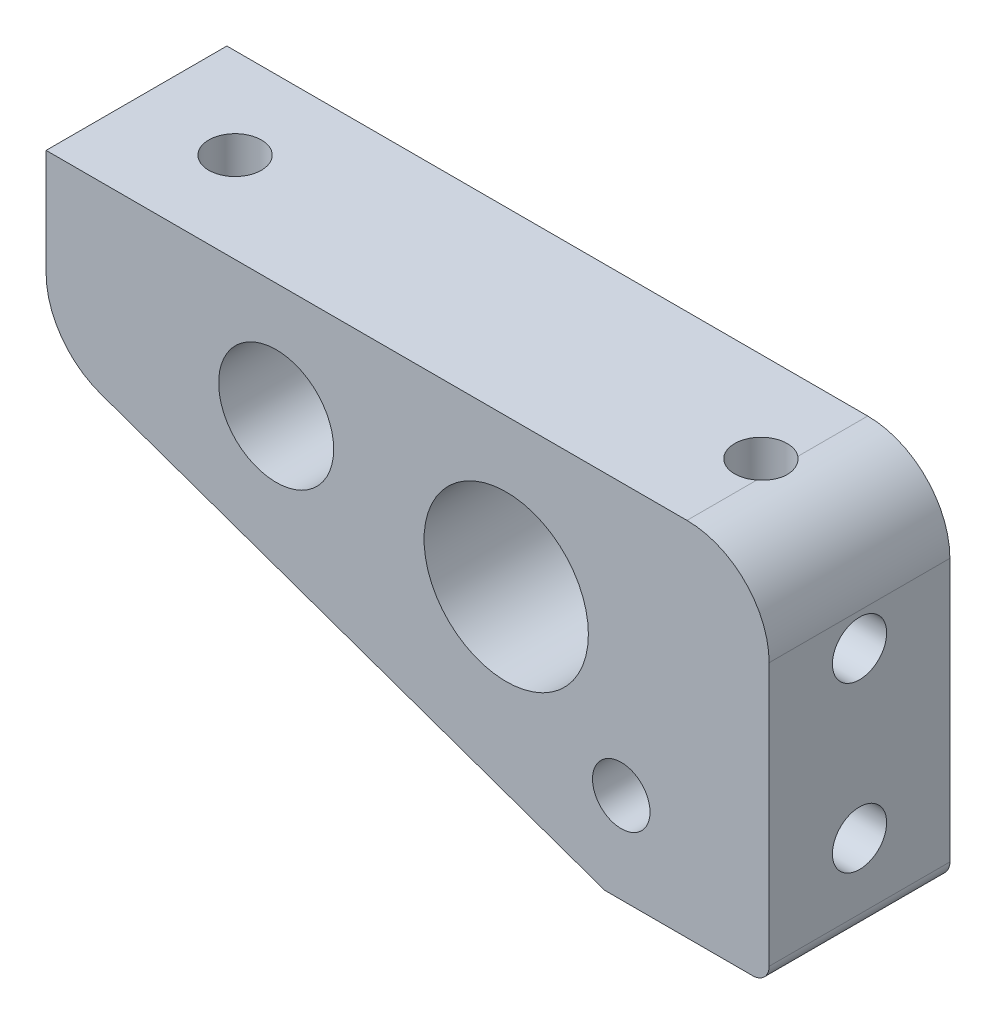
ISO-10303-21;
HEADER;
FILE_DESCRIPTION(('STEP AP214'),'2;1');
FILE_NAME('part.step','',(''),(''),'','','');
FILE_SCHEMA(('AUTOMOTIVE_DESIGN { 1 0 10303 214 1 1 1 1 }'));
ENDSEC;
DATA;
#1=APPLICATION_CONTEXT('core data for automotive mechanical design processes');
#2=APPLICATION_PROTOCOL_DEFINITION('international standard','automotive_design',2000,#1);
#3=PRODUCT_CONTEXT('',#1,'mechanical');
#4=PRODUCT('Part','Part','',(#3));
#5=PRODUCT_RELATED_PRODUCT_CATEGORY('part','',(#4));
#6=PRODUCT_DEFINITION_FORMATION('','',#4);
#7=PRODUCT_DEFINITION_CONTEXT('part definition',#1,'design');
#8=PRODUCT_DEFINITION('design','',#6,#7);
#9=PRODUCT_DEFINITION_SHAPE('','',#8);
#10=(LENGTH_UNIT() NAMED_UNIT(*) SI_UNIT(.MILLI.,.METRE.));
#11=(NAMED_UNIT(*) PLANE_ANGLE_UNIT() SI_UNIT($,.RADIAN.));
#12=(NAMED_UNIT(*) SI_UNIT($,.STERADIAN.) SOLID_ANGLE_UNIT());
#13=UNCERTAINTY_MEASURE_WITH_UNIT(LENGTH_MEASURE(1.E-05),#10,'distance_accuracy_value','');
#14=(GEOMETRIC_REPRESENTATION_CONTEXT(3) GLOBAL_UNCERTAINTY_ASSIGNED_CONTEXT((#13)) GLOBAL_UNIT_ASSIGNED_CONTEXT((#10,
#11,#12)) REPRESENTATION_CONTEXT('',''));
#15=CARTESIAN_POINT('',(0.,0.,0.));
#16=DIRECTION('',(0.,0.,1.));
#17=DIRECTION('',(1.,0.,0.));
#18=AXIS2_PLACEMENT_3D('',#15,#16,#17);
#19=CARTESIAN_POINT('',(0.,-10.,0.));
#20=DIRECTION('',(0.,1.,0.));
#21=DIRECTION('',(0.,0.,1.));
#22=AXIS2_PLACEMENT_3D('',#19,#20,#21);
#23=PLANE('',#22);
#24=CARTESIAN_POINT('',(-6.,-10.,0.));
#25=DIRECTION('',(0.,1.,0.));
#26=DIRECTION('',(0.,0.,1.));
#27=AXIS2_PLACEMENT_3D('',#24,#25,#26);
#28=CIRCLE('',#27,1.6);
#29=CARTESIAN_POINT('',(-6.,-10.,1.6));
#30=VERTEX_POINT('',#29);
#31=EDGE_CURVE('E20',#30,#30,#28,.T.);
#32=ORIENTED_EDGE('',*,*,#31,.T.);
#33=EDGE_LOOP('',(#32));
#34=FACE_BOUND('',#33,.T.);
#35=ADVANCED_FACE('F16',(#34),#23,.T.);
#36=CARTESIAN_POINT('',(-6.,0.,0.));
#37=DIRECTION('',(0.,1.,0.));
#38=DIRECTION('',(0.,0.,1.));
#39=AXIS2_PLACEMENT_3D('',#36,#37,#38);
#40=CYLINDRICAL_SURFACE('',#39,1.6);
#41=ORIENTED_EDGE('',*,*,#31,.F.);
#42=EDGE_LOOP('',(#41));
#43=FACE_BOUND('',#42,.T.);
#44=CARTESIAN_POINT('',(-7.6,-8.65,0.));
#45=CARTESIAN_POINT('',(-7.59999044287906,-8.64999049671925,0.0720842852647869));
#46=CARTESIAN_POINT('',(-7.59507938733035,-8.6452271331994,0.144295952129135));
#47=CARTESIAN_POINT('',(-7.57581147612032,-8.62655355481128,0.286344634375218));
#48=CARTESIAN_POINT('',(-7.56142638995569,-8.61261600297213,0.356173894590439));
#49=CARTESIAN_POINT('',(-7.52443546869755,-8.57682648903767,0.490854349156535));
#50=CARTESIAN_POINT('',(-7.50189028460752,-8.55503292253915,0.555738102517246));
#51=CARTESIAN_POINT('',(-7.44993008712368,-8.50490882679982,0.679881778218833));
#52=CARTESIAN_POINT('',(-7.42051635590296,-8.47657951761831,0.739142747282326));
#53=CARTESIAN_POINT('',(-7.3429151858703,-8.40205549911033,0.874594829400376));
#54=CARTESIAN_POINT('',(-7.29197093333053,-8.35329407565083,0.947789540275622));
#55=CARTESIAN_POINT('',(-7.18186309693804,-8.24860038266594,1.08202458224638));
#56=CARTESIAN_POINT('',(-7.12267566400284,-8.19264734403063,1.14302834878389));
#57=CARTESIAN_POINT('',(-7.01825487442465,-8.0950437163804,1.23544553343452));
#58=CARTESIAN_POINT('',(-6.97466827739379,-8.05459203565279,1.27006065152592));
#59=CARTESIAN_POINT('',(-6.88498918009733,-7.97230851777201,1.33410411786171));
#60=CARTESIAN_POINT('',(-6.83889513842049,-7.93047583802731,1.36352922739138));
#61=CARTESIAN_POINT('',(-6.74444096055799,-7.84630585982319,1.41730640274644));
#62=CARTESIAN_POINT('',(-6.69608435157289,-7.80396941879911,1.44166606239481));
#63=CARTESIAN_POINT('',(-6.59687253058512,-7.71975547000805,1.48549339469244));
#64=CARTESIAN_POINT('',(-6.54601954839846,-7.67787759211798,1.50496534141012));
#65=CARTESIAN_POINT('',(-6.45875091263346,-7.6103100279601,1.53325650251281));
#66=CARTESIAN_POINT('',(-6.42329544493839,-7.58395150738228,1.54344793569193));
#67=CARTESIAN_POINT('',(-6.35028297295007,-7.53337725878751,1.56164086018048));
#68=CARTESIAN_POINT('',(-6.31272620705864,-7.50916128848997,1.56964259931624));
#69=CARTESIAN_POINT('',(-6.24666455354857,-7.47206939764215,1.58110876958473));
#70=CARTESIAN_POINT('',(-6.21895465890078,-7.45800312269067,1.5852110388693));
#71=CARTESIAN_POINT('',(-6.16177587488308,-7.43359976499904,1.59205890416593));
#72=CARTESIAN_POINT('',(-6.13231281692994,-7.42325104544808,1.59480874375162));
#73=CARTESIAN_POINT('',(-6.0795537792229,-7.41031266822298,1.59817953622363));
#74=CARTESIAN_POINT('',(-6.05661629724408,-7.40641315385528,1.59916578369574));
#75=CARTESIAN_POINT('',(-6.01040944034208,-7.40259391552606,1.60013219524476));
#76=CARTESIAN_POINT('',(-5.98714072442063,-7.40266716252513,1.60011413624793));
#77=CARTESIAN_POINT('',(-5.9410635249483,-7.40674907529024,1.59908035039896));
#78=CARTESIAN_POINT('',(-5.91825391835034,-7.4107465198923,1.5980674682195));
#79=CARTESIAN_POINT('',(-5.87347506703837,-7.42194599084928,1.59514771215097));
#80=CARTESIAN_POINT('',(-5.85150808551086,-7.42915606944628,1.593238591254));
#81=CARTESIAN_POINT('',(-5.77614256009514,-7.4583685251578,1.58519513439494));
#82=CARTESIAN_POINT('',(-5.72535465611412,-7.48627049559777,1.57703306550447));
#83=CARTESIAN_POINT('',(-5.62779337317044,-7.54737257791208,1.55690736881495));
#84=CARTESIAN_POINT('',(-5.5810580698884,-7.58061598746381,1.54491180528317));
#85=CARTESIAN_POINT('',(-5.48618961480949,-7.65227572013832,1.51613192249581));
#86=CARTESIAN_POINT('',(-5.43830279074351,-7.6908890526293,1.49901621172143));
#87=CARTESIAN_POINT('',(-5.34481934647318,-7.76883412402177,1.46057975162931));
#88=CARTESIAN_POINT('',(-5.29922490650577,-7.80816650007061,1.43925509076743));
#89=CARTESIAN_POINT('',(-5.21020187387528,-7.88647461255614,1.39238604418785));
#90=CARTESIAN_POINT('',(-5.16676717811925,-7.9254510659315,1.36685454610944));
#91=CARTESIAN_POINT('',(-5.0819771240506,-8.00247437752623,1.31141046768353));
#92=CARTESIAN_POINT('',(-5.04062071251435,-8.04052170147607,1.28150013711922));
#93=CARTESIAN_POINT('',(-4.93509418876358,-8.13838585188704,1.19706890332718));
#94=CARTESIAN_POINT('',(-4.87273773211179,-8.19702015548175,1.13881365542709));
#95=CARTESIAN_POINT('',(-4.75575825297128,-8.30778148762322,1.00966691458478));
#96=CARTESIAN_POINT('',(-4.7011258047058,-8.35991643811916,0.938791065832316));
#97=CARTESIAN_POINT('',(-4.61410739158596,-8.44328901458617,0.802616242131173));
#98=CARTESIAN_POINT('',(-4.57951775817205,-8.47655083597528,0.739977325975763));
#99=CARTESIAN_POINT('',(-4.51811848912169,-8.53571000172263,0.607718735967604));
#100=CARTESIAN_POINT('',(-4.49130297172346,-8.56161291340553,0.538104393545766));
#101=CARTESIAN_POINT('',(-4.45040214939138,-8.60116542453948,0.403675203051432));
#102=CARTESIAN_POINT('',(-4.43504025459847,-8.61604188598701,0.339611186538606));
#103=CARTESIAN_POINT('',(-4.41231699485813,-8.63805650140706,0.208881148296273));
#104=CARTESIAN_POINT('',(-4.40493320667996,-8.64521634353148,0.142222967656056));
#105=CARTESIAN_POINT('',(-4.40058840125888,-8.64942948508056,0.0502172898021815));
#106=CARTESIAN_POINT('',(-4.39999667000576,-8.65000331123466,0.0251163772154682));
#107=CARTESIAN_POINT('',(-4.40000955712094,-8.64999049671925,-0.0720842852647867));
#108=CARTESIAN_POINT('',(-4.40492061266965,-8.6452271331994,-0.144295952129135));
#109=CARTESIAN_POINT('',(-4.42418852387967,-8.62655355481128,-0.286344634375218));
#110=CARTESIAN_POINT('',(-4.43857361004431,-8.61261600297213,-0.356173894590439));
#111=CARTESIAN_POINT('',(-4.47556453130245,-8.57682648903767,-0.490854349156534));
#112=CARTESIAN_POINT('',(-4.49810971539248,-8.55503292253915,-0.555738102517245));
#113=CARTESIAN_POINT('',(-4.55006991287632,-8.50490882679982,-0.679881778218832));
#114=CARTESIAN_POINT('',(-4.57948364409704,-8.47657951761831,-0.739142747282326));
#115=CARTESIAN_POINT('',(-4.6570848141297,-8.40205549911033,-0.874594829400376));
#116=CARTESIAN_POINT('',(-4.70802906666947,-8.35329407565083,-0.947789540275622));
#117=CARTESIAN_POINT('',(-4.81813690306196,-8.24860038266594,-1.08202458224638));
#118=CARTESIAN_POINT('',(-4.87732433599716,-8.19264734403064,-1.14302834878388));
#119=CARTESIAN_POINT('',(-4.98174512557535,-8.0950437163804,-1.23544553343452));
#120=CARTESIAN_POINT('',(-5.02533172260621,-8.05459203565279,-1.27006065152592));
#121=CARTESIAN_POINT('',(-5.11501081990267,-7.97230851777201,-1.33410411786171));
#122=CARTESIAN_POINT('',(-5.16110486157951,-7.93047583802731,-1.36352922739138));
#123=CARTESIAN_POINT('',(-5.25555903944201,-7.84630585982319,-1.41730640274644));
#124=CARTESIAN_POINT('',(-5.30391564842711,-7.80396941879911,-1.44166606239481));
#125=CARTESIAN_POINT('',(-5.40312746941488,-7.71975547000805,-1.48549339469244));
#126=CARTESIAN_POINT('',(-5.45398045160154,-7.67787759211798,-1.50496534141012));
#127=CARTESIAN_POINT('',(-5.54124908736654,-7.6103100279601,-1.53325650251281));
#128=CARTESIAN_POINT('',(-5.57670455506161,-7.58395150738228,-1.54344793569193));
#129=CARTESIAN_POINT('',(-5.64971702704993,-7.53337725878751,-1.56164086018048));
#130=CARTESIAN_POINT('',(-5.68727379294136,-7.50916128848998,-1.56964259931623));
#131=CARTESIAN_POINT('',(-5.75333544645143,-7.47206939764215,-1.58110876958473));
#132=CARTESIAN_POINT('',(-5.78104534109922,-7.45800312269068,-1.58521103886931));
#133=CARTESIAN_POINT('',(-5.83822412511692,-7.43359976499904,-1.59205890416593));
#134=CARTESIAN_POINT('',(-5.86768718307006,-7.42325104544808,-1.59480874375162));
#135=CARTESIAN_POINT('',(-5.9204462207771,-7.41031266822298,-1.59817953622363));
#136=CARTESIAN_POINT('',(-5.94338370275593,-7.40641315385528,-1.59916578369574));
#137=CARTESIAN_POINT('',(-5.98959055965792,-7.40259391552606,-1.60013219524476));
#138=CARTESIAN_POINT('',(-6.01285927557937,-7.40266716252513,-1.60011413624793));
#139=CARTESIAN_POINT('',(-6.0589364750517,-7.40674907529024,-1.59908035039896));
#140=CARTESIAN_POINT('',(-6.08174608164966,-7.4107465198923,-1.5980674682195));
#141=CARTESIAN_POINT('',(-6.12652493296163,-7.42194599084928,-1.59514771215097));
#142=CARTESIAN_POINT('',(-6.14849191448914,-7.42915606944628,-1.593238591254));
#143=CARTESIAN_POINT('',(-6.22385743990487,-7.4583685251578,-1.58519513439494));
#144=CARTESIAN_POINT('',(-6.27464534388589,-7.48627049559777,-1.57703306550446));
#145=CARTESIAN_POINT('',(-6.37220662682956,-7.54737257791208,-1.55690736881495));
#146=CARTESIAN_POINT('',(-6.41894193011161,-7.58061598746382,-1.54491180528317));
#147=CARTESIAN_POINT('',(-6.51381038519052,-7.65227572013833,-1.51613192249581));
#148=CARTESIAN_POINT('',(-6.56169720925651,-7.69088905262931,-1.49901621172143));
#149=CARTESIAN_POINT('',(-6.65518065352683,-7.76883412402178,-1.4605797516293));
#150=CARTESIAN_POINT('',(-6.70077509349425,-7.80816650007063,-1.43925509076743));
#151=CARTESIAN_POINT('',(-6.78979812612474,-7.88647461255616,-1.39238604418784));
#152=CARTESIAN_POINT('',(-6.83323282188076,-7.92545106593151,-1.36685454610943));
#153=CARTESIAN_POINT('',(-6.91802287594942,-8.00247437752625,-1.31141046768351));
#154=CARTESIAN_POINT('',(-6.95937928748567,-8.04052170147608,-1.2815001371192));
#155=CARTESIAN_POINT('',(-7.06490581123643,-8.13838585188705,-1.19706890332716));
#156=CARTESIAN_POINT('',(-7.12726226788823,-8.19702015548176,-1.13881365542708));
#157=CARTESIAN_POINT('',(-7.24424174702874,-8.30778148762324,-1.00966691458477));
#158=CARTESIAN_POINT('',(-7.29887419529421,-8.35991643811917,-0.938791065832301));
#159=CARTESIAN_POINT('',(-7.38589260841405,-8.44328901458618,-0.802616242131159));
#160=CARTESIAN_POINT('',(-7.42048224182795,-8.47655083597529,-0.739977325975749));
#161=CARTESIAN_POINT('',(-7.48188151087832,-8.53571000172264,-0.60771873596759));
#162=CARTESIAN_POINT('',(-7.50869702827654,-8.56161291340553,-0.538104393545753));
#163=CARTESIAN_POINT('',(-7.54959785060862,-8.60116542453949,-0.403675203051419));
#164=CARTESIAN_POINT('',(-7.56495974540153,-8.61604188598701,-0.339611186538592));
#165=CARTESIAN_POINT('',(-7.58768300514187,-8.63805650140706,-0.208881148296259));
#166=CARTESIAN_POINT('',(-7.59506679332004,-8.64521634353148,-0.142222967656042));
#167=CARTESIAN_POINT('',(-7.59941159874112,-8.64942948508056,-0.0502172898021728));
#168=CARTESIAN_POINT('',(-7.60000332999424,-8.65000331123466,-0.0251163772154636));
#169=CARTESIAN_POINT('',(-7.6,-8.65,0.));
#170=B_SPLINE_CURVE_WITH_KNOTS('',3,(#44,#45,#46,#47,#48,#49,#50,#51,#52,#53,#54,#55,#56,#57,
#58,#59,#60,#61,#62,#63,#64,#65,#66,#67,#68,#69,#70,#71,#72,#73,#74,#75,#76,#77,#78,#79,#80,#81,
#82,#83,#84,#85,#86,#87,#88,#89,#90,#91,#92,#93,#94,#95,#96,#97,#98,#99,#100,#101,#102,#103,
#104,#105,#106,#107,#108,#109,#110,#111,#112,#113,#114,#115,#116,#117,#118,#119,#120,#121,#122,
#123,#124,#125,#126,#127,#128,#129,#130,#131,#132,#133,#134,#135,#136,#137,#138,#139,#140,#141,
#142,#143,#144,#145,#146,#147,#148,#149,#150,#151,#152,#153,#154,#155,#156,#157,#158,#159,#160,
#161,#162,#163,#164,#165,#166,#167,#168,#169),.UNSPECIFIED.,.T.,.F.,(4,2,2,2,2,2,2,2,2,2,2,2,2,
2,2,2,2,2,2,2,2,2,2,2,2,2,2,2,2,2,2,2,2,2,2,2,2,2,2,2,2,2,2,2,2,2,2,2,2,2,2,2,2,2,2,2,2,2,2,2,2,
2,4),(0.,0.216164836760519,0.43297672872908,0.648209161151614,0.863401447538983,
1.16665917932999,1.47081326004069,1.67698968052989,1.88329430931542,2.08928739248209,
2.29509971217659,2.43103535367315,2.56695560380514,2.66081833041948,2.7543846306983,
2.82393118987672,2.89335470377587,2.9625802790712,3.03198034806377,3.20614545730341,
3.38180106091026,3.57310386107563,3.76458529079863,3.95549066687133,4.14629830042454,
4.45581255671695,4.76494578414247,5.00080613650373,5.23648757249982,5.43825506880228,
5.63945399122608,5.71477245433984,5.93093729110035,6.14774918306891,6.36298161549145,
6.57817390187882,6.88143163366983,7.18558571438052,7.39176213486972,7.59806676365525,
7.80405984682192,8.00987216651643,8.14580780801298,8.28172805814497,8.37559078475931,
8.46915708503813,8.53870364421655,8.6081271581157,8.67735273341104,8.7467528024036,
8.92091791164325,9.0965735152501,9.28787631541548,9.47935774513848,9.67026312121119,
9.8610707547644,10.1705850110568,10.4797182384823,10.7155785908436,10.9512600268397,
11.1530275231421,11.3542264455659,11.4295449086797),.UNSPECIFIED.);
#171=CARTESIAN_POINT('',(-7.6,-8.65,0.));
#172=VERTEX_POINT('',#171);
#173=EDGE_CURVE('E258',#172,#172,#170,.T.);
#174=ORIENTED_EDGE('',*,*,#173,.T.);
#175=EDGE_LOOP('',(#174));
#176=FACE_BOUND('',#175,.T.);
#177=ADVANCED_FACE('F263',(#43,#176),#40,.F.);
#178=CARTESIAN_POINT('',(-10.,0.,0.));
#179=DIRECTION('',(1.,0.,0.));
#180=DIRECTION('',(0.,0.,-1.));
#181=AXIS2_PLACEMENT_3D('',#178,#179,#180);
#182=PLANE('',#181);
#183=CARTESIAN_POINT('',(-10.,-7.,0.));
#184=DIRECTION('',(1.,0.,0.));
#185=DIRECTION('',(0.,0.,-1.));
#186=AXIS2_PLACEMENT_3D('',#183,#184,#185);
#187=CIRCLE('',#186,1.65);
#188=CARTESIAN_POINT('',(-10.,-7.,-1.65));
#189=VERTEX_POINT('',#188);
#190=EDGE_CURVE('E256',#189,#189,#187,.T.);
#191=ORIENTED_EDGE('',*,*,#190,.T.);
#192=EDGE_LOOP('',(#191));
#193=FACE_BOUND('',#192,.T.);
#194=ADVANCED_FACE('F268',(#193),#182,.T.);
#195=CARTESIAN_POINT('',(0.,-10.,0.));
#196=DIRECTION('',(0.,1.,0.));
#197=DIRECTION('',(0.,0.,1.));
#198=AXIS2_PLACEMENT_3D('',#195,#196,#197);
#199=PLANE('',#198);
#200=CARTESIAN_POINT('',(-38.,-10.,0.));
#201=DIRECTION('',(0.,1.,0.));
#202=DIRECTION('',(0.,0.,1.));
#203=AXIS2_PLACEMENT_3D('',#200,#201,#202);
#204=CIRCLE('',#203,1.6);
#205=CARTESIAN_POINT('',(-38.,-10.,1.6));
#206=VERTEX_POINT('',#205);
#207=EDGE_CURVE('E103',#206,#206,#204,.T.);
#208=ORIENTED_EDGE('',*,*,#207,.T.);
#209=EDGE_LOOP('',(#208));
#210=FACE_BOUND('',#209,.T.);
#211=ADVANCED_FACE('F271',(#210),#199,.T.);
#212=CARTESIAN_POINT('',(0.,-7.,0.));
#213=DIRECTION('',(1.,0.,0.));
#214=DIRECTION('',(0.,0.,-1.));
#215=AXIS2_PLACEMENT_3D('',#212,#213,#214);
#216=CYLINDRICAL_SURFACE('',#215,1.65);
#217=ORIENTED_EDGE('',*,*,#190,.F.);
#218=EDGE_LOOP('',(#217));
#219=FACE_BOUND('',#218,.T.);
#220=CARTESIAN_POINT('',(-4.4,-5.35,0.));
#221=CARTESIAN_POINT('',(-4.40000955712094,-5.35000950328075,-0.0720842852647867));
#222=CARTESIAN_POINT('',(-4.40492061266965,-5.35477286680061,-0.144295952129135));
#223=CARTESIAN_POINT('',(-4.42418852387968,-5.37344644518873,-0.286344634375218));
#224=CARTESIAN_POINT('',(-4.43857361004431,-5.38738399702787,-0.356173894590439));
#225=CARTESIAN_POINT('',(-4.47556453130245,-5.42317351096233,-0.490854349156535));
#226=CARTESIAN_POINT('',(-4.49810971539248,-5.44496707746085,-0.555738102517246));
#227=CARTESIAN_POINT('',(-4.55006991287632,-5.49509117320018,-0.679881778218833));
#228=CARTESIAN_POINT('',(-4.57948364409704,-5.52342048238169,-0.739142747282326));
#229=CARTESIAN_POINT('',(-4.6570848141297,-5.59794450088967,-0.874594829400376));
#230=CARTESIAN_POINT('',(-4.70802906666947,-5.64670592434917,-0.947789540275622));
#231=CARTESIAN_POINT('',(-4.81813690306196,-5.75139961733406,-1.08202458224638));
#232=CARTESIAN_POINT('',(-4.87732433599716,-5.80735265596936,-1.14302834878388));
#233=CARTESIAN_POINT('',(-4.98174512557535,-5.9049562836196,-1.23544553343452));
#234=CARTESIAN_POINT('',(-5.02533172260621,-5.94540796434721,-1.27006065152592));
#235=CARTESIAN_POINT('',(-5.11501081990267,-6.02769148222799,-1.33410411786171));
#236=CARTESIAN_POINT('',(-5.16110486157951,-6.06952416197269,-1.36352922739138));
#237=CARTESIAN_POINT('',(-5.25555903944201,-6.15369414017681,-1.41730640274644));
#238=CARTESIAN_POINT('',(-5.30391564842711,-6.19603058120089,-1.44166606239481));
#239=CARTESIAN_POINT('',(-5.40312746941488,-6.28024452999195,-1.48549339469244));
#240=CARTESIAN_POINT('',(-5.45398045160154,-6.32212240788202,-1.50496534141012));
#241=CARTESIAN_POINT('',(-5.54124908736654,-6.3896899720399,-1.53325650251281));
#242=CARTESIAN_POINT('',(-5.57670455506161,-6.41604849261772,-1.54344793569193));
#243=CARTESIAN_POINT('',(-5.64971702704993,-6.46662274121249,-1.56164086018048));
#244=CARTESIAN_POINT('',(-5.68727379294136,-6.49083871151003,-1.56964259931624));
#245=CARTESIAN_POINT('',(-5.75333544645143,-6.52793060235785,-1.58110876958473));
#246=CARTESIAN_POINT('',(-5.78104534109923,-6.54199687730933,-1.5852110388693));
#247=CARTESIAN_POINT('',(-5.83822412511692,-6.56640023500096,-1.59205890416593));
#248=CARTESIAN_POINT('',(-5.86768718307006,-6.57674895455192,-1.59480874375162));
#249=CARTESIAN_POINT('',(-5.9204462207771,-6.58968733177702,-1.59817953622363));
#250=CARTESIAN_POINT('',(-5.94338370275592,-6.59358684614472,-1.59916578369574));
#251=CARTESIAN_POINT('',(-5.98959055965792,-6.59740608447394,-1.60013219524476));
#252=CARTESIAN_POINT('',(-6.01285927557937,-6.59733283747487,-1.60011413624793));
#253=CARTESIAN_POINT('',(-6.0589364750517,-6.59325092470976,-1.59908035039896));
#254=CARTESIAN_POINT('',(-6.08174608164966,-6.5892534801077,-1.5980674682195));
#255=CARTESIAN_POINT('',(-6.12652493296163,-6.57805400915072,-1.59514771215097));
#256=CARTESIAN_POINT('',(-6.14849191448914,-6.57084393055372,-1.593238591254));
#257=CARTESIAN_POINT('',(-6.22385743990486,-6.5416314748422,-1.58519513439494));
#258=CARTESIAN_POINT('',(-6.27464534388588,-6.51372950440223,-1.57703306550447));
#259=CARTESIAN_POINT('',(-6.37220662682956,-6.45262742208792,-1.55690736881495));
#260=CARTESIAN_POINT('',(-6.4189419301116,-6.41938401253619,-1.54491180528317));
#261=CARTESIAN_POINT('',(-6.51381038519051,-6.34772427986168,-1.51613192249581));
#262=CARTESIAN_POINT('',(-6.5616972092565,-6.3091109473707,-1.49901621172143));
#263=CARTESIAN_POINT('',(-6.65518065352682,-6.23116587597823,-1.46057975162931));
#264=CARTESIAN_POINT('',(-6.70077509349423,-6.19183349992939,-1.43925509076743));
#265=CARTESIAN_POINT('',(-6.78979812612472,-6.11352538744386,-1.39238604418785));
#266=CARTESIAN_POINT('',(-6.83323282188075,-6.0745489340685,-1.36685454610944));
#267=CARTESIAN_POINT('',(-6.9180228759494,-5.99752562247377,-1.31141046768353));
#268=CARTESIAN_POINT('',(-6.95937928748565,-5.95947829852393,-1.28150013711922));
#269=CARTESIAN_POINT('',(-7.06490581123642,-5.86161414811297,-1.19706890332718));
#270=CARTESIAN_POINT('',(-7.12726226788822,-5.80297984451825,-1.13881365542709));
#271=CARTESIAN_POINT('',(-7.24424174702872,-5.69221851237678,-1.00966691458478));
#272=CARTESIAN_POINT('',(-7.2988741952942,-5.64008356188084,-0.938791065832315));
#273=CARTESIAN_POINT('',(-7.38589260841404,-5.55671098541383,-0.802616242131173));
#274=CARTESIAN_POINT('',(-7.42048224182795,-5.52344916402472,-0.739977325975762));
#275=CARTESIAN_POINT('',(-7.48188151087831,-5.46428999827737,-0.607718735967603));
#276=CARTESIAN_POINT('',(-7.50869702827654,-5.43838708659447,-0.538104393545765));
#277=CARTESIAN_POINT('',(-7.54959785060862,-5.39883457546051,-0.403675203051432));
#278=CARTESIAN_POINT('',(-7.56495974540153,-5.38395811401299,-0.339611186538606));
#279=CARTESIAN_POINT('',(-7.58768300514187,-5.36194349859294,-0.208881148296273));
#280=CARTESIAN_POINT('',(-7.59506679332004,-5.35478365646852,-0.142222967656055));
#281=CARTESIAN_POINT('',(-7.59941159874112,-5.35057051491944,-0.050217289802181));
#282=CARTESIAN_POINT('',(-7.60000332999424,-5.34999668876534,-0.0251163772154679));
#283=CARTESIAN_POINT('',(-7.59999044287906,-5.35000950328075,0.0720842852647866));
#284=CARTESIAN_POINT('',(-7.59507938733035,-5.35477286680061,0.144295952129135));
#285=CARTESIAN_POINT('',(-7.57581147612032,-5.37344644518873,0.286344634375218));
#286=CARTESIAN_POINT('',(-7.56142638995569,-5.38738399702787,0.356173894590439));
#287=CARTESIAN_POINT('',(-7.52443546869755,-5.42317351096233,0.490854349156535));
#288=CARTESIAN_POINT('',(-7.50189028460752,-5.44496707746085,0.555738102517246));
#289=CARTESIAN_POINT('',(-7.44993008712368,-5.49509117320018,0.679881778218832));
#290=CARTESIAN_POINT('',(-7.42051635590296,-5.52342048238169,0.739142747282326));
#291=CARTESIAN_POINT('',(-7.3429151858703,-5.59794450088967,0.874594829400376));
#292=CARTESIAN_POINT('',(-7.29197093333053,-5.64670592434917,0.947789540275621));
#293=CARTESIAN_POINT('',(-7.18186309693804,-5.75139961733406,1.08202458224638));
#294=CARTESIAN_POINT('',(-7.12267566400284,-5.80735265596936,1.14302834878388));
#295=CARTESIAN_POINT('',(-7.01825487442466,-5.9049562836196,1.23544553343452));
#296=CARTESIAN_POINT('',(-6.97466827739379,-5.94540796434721,1.27006065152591));
#297=CARTESIAN_POINT('',(-6.88498918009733,-6.02769148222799,1.33410411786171));
#298=CARTESIAN_POINT('',(-6.83889513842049,-6.06952416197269,1.36352922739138));
#299=CARTESIAN_POINT('',(-6.74444096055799,-6.15369414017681,1.41730640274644));
#300=CARTESIAN_POINT('',(-6.69608435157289,-6.19603058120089,1.44166606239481));
#301=CARTESIAN_POINT('',(-6.59687253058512,-6.28024452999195,1.48549339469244));
#302=CARTESIAN_POINT('',(-6.54601954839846,-6.32212240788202,1.50496534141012));
#303=CARTESIAN_POINT('',(-6.45875091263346,-6.3896899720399,1.53325650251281));
#304=CARTESIAN_POINT('',(-6.42329544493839,-6.41604849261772,1.54344793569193));
#305=CARTESIAN_POINT('',(-6.35028297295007,-6.46662274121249,1.56164086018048));
#306=CARTESIAN_POINT('',(-6.31272620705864,-6.49083871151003,1.56964259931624));
#307=CARTESIAN_POINT('',(-6.24666455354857,-6.52793060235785,1.58110876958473));
#308=CARTESIAN_POINT('',(-6.21895465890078,-6.54199687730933,1.5852110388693));
#309=CARTESIAN_POINT('',(-6.16177587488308,-6.56640023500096,1.59205890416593));
#310=CARTESIAN_POINT('',(-6.13231281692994,-6.57674895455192,1.59480874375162));
#311=CARTESIAN_POINT('',(-6.0795537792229,-6.58968733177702,1.59817953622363));
#312=CARTESIAN_POINT('',(-6.05661629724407,-6.59358684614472,1.59916578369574));
#313=CARTESIAN_POINT('',(-6.01040944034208,-6.59740608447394,1.60013219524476));
#314=CARTESIAN_POINT('',(-5.98714072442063,-6.59733283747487,1.60011413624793));
#315=CARTESIAN_POINT('',(-5.9410635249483,-6.59325092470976,1.59908035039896));
#316=CARTESIAN_POINT('',(-5.91825391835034,-6.5892534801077,1.5980674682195));
#317=CARTESIAN_POINT('',(-5.87347506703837,-6.57805400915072,1.59514771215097));
#318=CARTESIAN_POINT('',(-5.85150808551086,-6.57084393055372,1.593238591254));
#319=CARTESIAN_POINT('',(-5.77614256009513,-6.5416314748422,1.58519513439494));
#320=CARTESIAN_POINT('',(-5.72535465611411,-6.51372950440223,1.57703306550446));
#321=CARTESIAN_POINT('',(-5.62779337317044,-6.45262742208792,1.55690736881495));
#322=CARTESIAN_POINT('',(-5.58105806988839,-6.41938401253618,1.54491180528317));
#323=CARTESIAN_POINT('',(-5.48618961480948,-6.34772427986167,1.51613192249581));
#324=CARTESIAN_POINT('',(-5.43830279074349,-6.30911094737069,1.49901621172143));
#325=CARTESIAN_POINT('',(-5.34481934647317,-6.23116587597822,1.4605797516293));
#326=CARTESIAN_POINT('',(-5.29922490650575,-6.19183349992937,1.43925509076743));
#327=CARTESIAN_POINT('',(-5.21020187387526,-6.11352538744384,1.39238604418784));
#328=CARTESIAN_POINT('',(-5.16676717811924,-6.07454893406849,1.36685454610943));
#329=CARTESIAN_POINT('',(-5.08197712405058,-5.99752562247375,1.31141046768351));
#330=CARTESIAN_POINT('',(-5.04062071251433,-5.95947829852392,1.2815001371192));
#331=CARTESIAN_POINT('',(-4.93509418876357,-5.86161414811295,1.19706890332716));
#332=CARTESIAN_POINT('',(-4.87273773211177,-5.80297984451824,1.13881365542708));
#333=CARTESIAN_POINT('',(-4.75575825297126,-5.69221851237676,1.00966691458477));
#334=CARTESIAN_POINT('',(-4.70112580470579,-5.64008356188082,0.938791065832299));
#335=CARTESIAN_POINT('',(-4.61410739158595,-5.55671098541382,0.802616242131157));
#336=CARTESIAN_POINT('',(-4.57951775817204,-5.52344916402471,0.739977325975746));
#337=CARTESIAN_POINT('',(-4.51811848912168,-5.46428999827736,0.607718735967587));
#338=CARTESIAN_POINT('',(-4.49130297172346,-5.43838708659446,0.538104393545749));
#339=CARTESIAN_POINT('',(-4.45040214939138,-5.39883457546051,0.403675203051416));
#340=CARTESIAN_POINT('',(-4.43504025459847,-5.38395811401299,0.33961118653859));
#341=CARTESIAN_POINT('',(-4.41231699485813,-5.36194349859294,0.208881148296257));
#342=CARTESIAN_POINT('',(-4.40493320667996,-5.35478365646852,0.142222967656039));
#343=CARTESIAN_POINT('',(-4.40058840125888,-5.35057051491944,0.0502172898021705));
#344=CARTESIAN_POINT('',(-4.39999667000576,-5.34999668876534,0.0251163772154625));
#345=CARTESIAN_POINT('',(-4.4,-5.35,0.));
#346=B_SPLINE_CURVE_WITH_KNOTS('',3,(#220,#221,#222,#223,#224,#225,#226,#227,#228,#229,#230,
#231,#232,#233,#234,#235,#236,#237,#238,#239,#240,#241,#242,#243,#244,#245,#246,#247,#248,#249,
#250,#251,#252,#253,#254,#255,#256,#257,#258,#259,#260,#261,#262,#263,#264,#265,#266,#267,#268,
#269,#270,#271,#272,#273,#274,#275,#276,#277,#278,#279,#280,#281,#282,#283,#284,#285,#286,#287,
#288,#289,#290,#291,#292,#293,#294,#295,#296,#297,#298,#299,#300,#301,#302,#303,#304,#305,#306,
#307,#308,#309,#310,#311,#312,#313,#314,#315,#316,#317,#318,#319,#320,#321,#322,#323,#324,#325,
#326,#327,#328,#329,#330,#331,#332,#333,#334,#335,#336,#337,#338,#339,#340,#341,#342,#343,#344,
#345),.UNSPECIFIED.,.T.,.F.,(4,2,2,2,2,2,2,2,2,2,2,2,2,2,2,2,2,2,2,2,2,2,2,2,2,2,2,2,2,2,2,2,2,
2,2,2,2,2,2,2,2,2,2,2,2,2,2,2,2,2,2,2,2,2,2,2,2,2,2,2,2,2,4),(0.,0.216164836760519,
0.43297672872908,0.648209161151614,0.863401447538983,1.16665917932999,1.47081326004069,
1.67698968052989,1.88329430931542,2.08928739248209,2.29509971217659,2.43103535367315,
2.56695560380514,2.66081833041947,2.7543846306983,2.82393118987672,2.89335470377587,
2.9625802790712,3.03198034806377,3.20614545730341,3.38180106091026,3.57310386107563,
3.76458529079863,3.95549066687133,4.14629830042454,4.45581255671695,4.76494578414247,
5.00080613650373,5.23648757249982,5.43825506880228,5.63945399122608,5.71477245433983,
5.93093729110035,6.14774918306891,6.36298161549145,6.57817390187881,6.88143163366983,
7.18558571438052,7.39176213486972,7.59806676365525,7.80405984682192,8.00987216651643,
8.14580780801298,8.28172805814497,8.37559078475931,8.46915708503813,8.53870364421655,
8.6081271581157,8.67735273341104,8.74675280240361,8.92091791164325,9.09657351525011,
9.28787631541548,9.47935774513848,9.67026312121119,9.86107075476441,10.1705850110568,
10.4797182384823,10.7155785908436,10.9512600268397,11.1530275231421,11.3542264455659,
11.4295449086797),.UNSPECIFIED.);
#347=CARTESIAN_POINT('',(-4.4,-5.35,0.));
#348=VERTEX_POINT('',#347);
#349=EDGE_CURVE('E250',#348,#348,#346,.T.);
#350=ORIENTED_EDGE('',*,*,#349,.T.);
#351=EDGE_LOOP('',(#350));
#352=FACE_BOUND('',#351,.T.);
#353=CARTESIAN_POINT('',(0.,-7.,0.));
#354=DIRECTION('',(1.,0.,0.));
#355=DIRECTION('',(0.,0.,-1.));
#356=AXIS2_PLACEMENT_3D('',#353,#354,#355);
#357=CIRCLE('',#356,1.65);
#358=CARTESIAN_POINT('',(0.,-7.,-1.65));
#359=VERTEX_POINT('',#358);
#360=EDGE_CURVE('E111',#359,#359,#357,.F.);
#361=ORIENTED_EDGE('',*,*,#360,.F.);
#362=EDGE_LOOP('',(#361));
#363=FACE_BOUND('',#362,.T.);
#364=ORIENTED_EDGE('',*,*,#173,.F.);
#365=EDGE_LOOP('',(#364));
#366=FACE_BOUND('',#365,.T.);
#367=ADVANCED_FACE('F243',(#219,#352,#363,#366),#216,.F.);
#368=CARTESIAN_POINT('',(-6.,0.,0.));
#369=DIRECTION('',(0.,1.,0.));
#370=DIRECTION('',(0.,0.,1.));
#371=AXIS2_PLACEMENT_3D('',#368,#369,#370);
#372=CYLINDRICAL_SURFACE('',#371,1.6);
#373=ORIENTED_EDGE('',*,*,#349,.F.);
#374=EDGE_LOOP('',(#373));
#375=FACE_BOUND('',#374,.T.);
#376=CARTESIAN_POINT('',(-6.,0.,0.));
#377=DIRECTION('',(0.,1.,0.));
#378=DIRECTION('',(0.,0.,1.));
#379=AXIS2_PLACEMENT_3D('',#376,#377,#378);
#380=CIRCLE('',#379,1.6);
#381=CARTESIAN_POINT('',(-5.00000000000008,0.,1.24899959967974));
#382=VERTEX_POINT('',#381);
#383=CARTESIAN_POINT('',(-5.00000000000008,0.,-1.24899959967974));
#384=VERTEX_POINT('',#383);
#385=EDGE_CURVE('E234',#382,#384,#380,.F.);
#386=ORIENTED_EDGE('',*,*,#385,.F.);
#387=CARTESIAN_POINT('',(-5.00000000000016,0.,-1.24899959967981));
#388=CARTESIAN_POINT('',(-4.96495911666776,6.13198020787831E-07,-1.22094424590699));
#389=CARTESIAN_POINT('',(-4.93111818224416,-0.0003684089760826,-1.19142858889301));
#390=CARTESIAN_POINT('',(-4.86604320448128,-0.00168897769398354,-1.12967072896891));
#391=CARTESIAN_POINT('',(-4.83480882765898,-0.0026404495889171,-1.09742887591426));
#392=CARTESIAN_POINT('',(-4.74534850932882,-0.0061322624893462,-0.996933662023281));
#393=CARTESIAN_POINT('',(-4.69132307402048,-0.00931037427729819,-0.924876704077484));
#394=CARTESIAN_POINT('',(-4.59611921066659,-0.016108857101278,-0.772777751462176));
#395=CARTESIAN_POINT('',(-4.55494450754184,-0.0197293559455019,-0.692733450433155));
#396=CARTESIAN_POINT('',(-4.48661155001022,-0.0263073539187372,-0.526942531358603));
#397=CARTESIAN_POINT('',(-4.45943172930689,-0.0292658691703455,-0.441204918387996));
#398=CARTESIAN_POINT('',(-4.42646281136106,-0.0329867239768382,-0.295847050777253));
#399=CARTESIAN_POINT('',(-4.41655422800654,-0.0341530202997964,-0.23713782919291));
#400=CARTESIAN_POINT('',(-4.40332099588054,-0.035725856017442,-0.118961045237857));
#401=CARTESIAN_POINT('',(-4.39999747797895,-0.0361322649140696,-0.0594933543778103));
#402=CARTESIAN_POINT('',(-4.40000380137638,-0.0361279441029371,0.0896727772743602));
#403=CARTESIAN_POINT('',(-4.40756394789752,-0.0351981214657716,0.179403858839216));
#404=CARTESIAN_POINT('',(-4.43760704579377,-0.0317071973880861,0.356370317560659));
#405=CARTESIAN_POINT('',(-4.4601067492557,-0.0291442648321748,0.443602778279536));
#406=CARTESIAN_POINT('',(-4.51936562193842,-0.023065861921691,0.613001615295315));
#407=CARTESIAN_POINT('',(-4.55611890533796,-0.0195507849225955,0.695170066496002));
#408=CARTESIAN_POINT('',(-4.64284825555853,-0.0125835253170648,0.852155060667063));
#409=CARTESIAN_POINT('',(-4.69281362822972,-0.00913129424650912,0.92697748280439));
#410=CARTESIAN_POINT('',(-4.78571670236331,-0.00445652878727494,1.04357937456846));
#411=CARTESIAN_POINT('',(-4.82536301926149,-0.00287460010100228,1.08800645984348));
#412=CARTESIAN_POINT('',(-4.90930758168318,-0.000646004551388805,1.17214457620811));
#413=CARTESIAN_POINT('',(-4.95360035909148,1.74872572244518E-06,1.21186103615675));
#414=CARTESIAN_POINT('',(-5.00000000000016,0.,1.24899959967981));
#415=B_SPLINE_CURVE_WITH_KNOTS('',3,(#387,#388,#389,#390,#391,#392,#393,#394,#395,#396,#397,
#398,#399,#400,#401,#402,#403,#404,#405,#406,#407,#408,#409,#410,#411,#412,#413,#414),
.UNSPECIFIED.,.F.,.F.,(4,2,2,2,2,2,2,2,2,2,2,2,2,4),(0.,0.134577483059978,0.269137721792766,
0.538097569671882,0.807135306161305,1.07575720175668,1.2540622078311,1.43239783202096,
1.70119845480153,1.97030100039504,2.23929254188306,2.50806701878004,2.68641399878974,
2.86455339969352),.UNSPECIFIED.);
#416=EDGE_CURVE('E227',#384,#382,#415,.T.);
#417=ORIENTED_EDGE('',*,*,#416,.F.);
#418=EDGE_LOOP('',(#386,#417));
#419=FACE_BOUND('',#418,.T.);
#420=ADVANCED_FACE('F237',(#375,#419),#372,.F.);
#421=CARTESIAN_POINT('',(-38.,0.,0.));
#422=DIRECTION('',(0.,1.,0.));
#423=DIRECTION('',(0.,0.,1.));
#424=AXIS2_PLACEMENT_3D('',#421,#422,#423);
#425=CYLINDRICAL_SURFACE('',#424,1.6);
#426=ORIENTED_EDGE('',*,*,#207,.F.);
#427=EDGE_LOOP('',(#426));
#428=FACE_BOUND('',#427,.T.);
#429=CARTESIAN_POINT('',(-38.,0.,0.));
#430=DIRECTION('',(0.,1.,0.));
#431=DIRECTION('',(0.,0.,1.));
#432=AXIS2_PLACEMENT_3D('',#429,#430,#431);
#433=CIRCLE('',#432,1.6);
#434=CARTESIAN_POINT('',(-38.,0.,1.6));
#435=VERTEX_POINT('',#434);
#436=EDGE_CURVE('E148',#435,#435,#433,.F.);
#437=ORIENTED_EDGE('',*,*,#436,.F.);
#438=EDGE_LOOP('',(#437));
#439=FACE_BOUND('',#438,.T.);
#440=ADVANCED_FACE('F242',(#428,#439),#425,.F.);
#441=CARTESIAN_POINT('',(-1.,-21.,19.8396));
#442=DIRECTION('',(0.,0.,-1.));
#443=DIRECTION('',(-1.,0.,0.));
#444=AXIS2_PLACEMENT_3D('',#441,#442,#443);
#445=CYLINDRICAL_SURFACE('',#444,1.);
#446=DIRECTION('',(0.,0.,-1.));
#447=VECTOR('',#446,1.);
#448=CARTESIAN_POINT('',(-0.999999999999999,-22.,-5.5));
#449=LINE('',#448,#447);
#450=CARTESIAN_POINT('',(-1.,-22.,-5.5));
#451=VERTEX_POINT('',#450);
#452=CARTESIAN_POINT('',(-1.,-22.,5.5));
#453=VERTEX_POINT('',#452);
#454=EDGE_CURVE('E129',#451,#453,#449,.F.);
#455=ORIENTED_EDGE('',*,*,#454,.F.);
#456=CARTESIAN_POINT('',(-1.,-21.,-5.5));
#457=DIRECTION('',(0.,0.,-1.));
#458=DIRECTION('',(-1.,0.,0.));
#459=AXIS2_PLACEMENT_3D('',#456,#457,#458);
#460=CIRCLE('',#459,1.);
#461=CARTESIAN_POINT('',(0.,-21.,-5.5));
#462=VERTEX_POINT('',#461);
#463=EDGE_CURVE('E108',#451,#462,#460,.F.);
#464=ORIENTED_EDGE('',*,*,#463,.T.);
#465=DIRECTION('',(0.,0.,-1.));
#466=VECTOR('',#465,1.);
#467=CARTESIAN_POINT('',(0.,-21.,-5.5));
#468=LINE('',#467,#466);
#469=CARTESIAN_POINT('',(0.,-21.,5.5));
#470=VERTEX_POINT('',#469);
#471=EDGE_CURVE('E106',#470,#462,#468,.T.);
#472=ORIENTED_EDGE('',*,*,#471,.F.);
#473=CARTESIAN_POINT('',(-1.,-21.,5.5));
#474=DIRECTION('',(0.,0.,-1.));
#475=DIRECTION('',(-1.,0.,0.));
#476=AXIS2_PLACEMENT_3D('',#473,#474,#475);
#477=CIRCLE('',#476,1.);
#478=EDGE_CURVE('E33',#470,#453,#477,.T.);
#479=ORIENTED_EDGE('',*,*,#478,.T.);
#480=EDGE_LOOP('',(#455,#464,#472,#479));
#481=FACE_BOUND('',#480,.T.);
#482=ADVANCED_FACE('F107',(#481),#445,.T.);
#483=CARTESIAN_POINT('',(-10.,0.,0.));
#484=DIRECTION('',(1.,0.,0.));
#485=DIRECTION('',(0.,0.,-1.));
#486=AXIS2_PLACEMENT_3D('',#483,#484,#485);
#487=PLANE('',#486);
#488=CARTESIAN_POINT('',(-10.,-17.,0.));
#489=DIRECTION('',(1.,0.,0.));
#490=DIRECTION('',(0.,0.,-1.));
#491=AXIS2_PLACEMENT_3D('',#488,#489,#490);
#492=CIRCLE('',#491,1.65);
#493=CARTESIAN_POINT('',(-10.0000000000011,-17.9361406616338,1.35872758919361));
#494=VERTEX_POINT('',#493);
#495=CARTESIAN_POINT('',(-10.0000000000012,-17.9361406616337,-1.35872758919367));
#496=VERTEX_POINT('',#495);
#497=EDGE_CURVE('E102',#494,#496,#492,.T.);
#498=ORIENTED_EDGE('',*,*,#497,.T.);
#499=DIRECTION('',(0.,0.,1.));
#500=VECTOR('',#499,1.);
#501=CARTESIAN_POINT('',(-10.0000000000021,-17.936140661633,-6.6));
#502=LINE('',#501,#500);
#503=EDGE_CURVE('E297',#496,#494,#502,.T.);
#504=ORIENTED_EDGE('',*,*,#503,.T.);
#505=EDGE_LOOP('',(#498,#504));
#506=FACE_BOUND('',#505,.T.);
#507=ADVANCED_FACE('F348',(#506),#487,.T.);
#508=CARTESIAN_POINT('',(0.,0.,-5.5));
#509=DIRECTION('',(0.,0.,1.));
#510=DIRECTION('',(1.,0.,0.));
#511=AXIS2_PLACEMENT_3D('',#508,#509,#510);
#512=PLANE('',#511);
#513=CARTESIAN_POINT('',(-9.,-16.5,-5.5));
#514=DIRECTION('',(0.,0.,1.));
#515=DIRECTION('',(1.,0.,0.));
#516=AXIS2_PLACEMENT_3D('',#513,#514,#515);
#517=CIRCLE('',#516,1.75);
#518=CARTESIAN_POINT('',(-7.25,-16.5,-5.5));
#519=VERTEX_POINT('',#518);
#520=EDGE_CURVE('E123',#519,#519,#517,.T.);
#521=ORIENTED_EDGE('',*,*,#520,.T.);
#522=EDGE_LOOP('',(#521));
#523=FACE_BOUND('',#522,.T.);
#524=CARTESIAN_POINT('',(-30.,-7.,-5.5));
#525=DIRECTION('',(0.,0.,1.));
#526=DIRECTION('',(1.,0.,0.));
#527=AXIS2_PLACEMENT_3D('',#524,#525,#526);
#528=CIRCLE('',#527,3.5);
#529=CARTESIAN_POINT('',(-26.5,-7.,-5.5));
#530=VERTEX_POINT('',#529);
#531=EDGE_CURVE('E294',#530,#530,#528,.T.);
#532=ORIENTED_EDGE('',*,*,#531,.T.);
#533=EDGE_LOOP('',(#532));
#534=FACE_BOUND('',#533,.T.);
#535=CARTESIAN_POINT('',(-16.,-9.,-5.5));
#536=DIRECTION('',(0.,0.,1.));
#537=DIRECTION('',(1.,0.,0.));
#538=AXIS2_PLACEMENT_3D('',#535,#536,#537);
#539=CIRCLE('',#538,5.);
#540=CARTESIAN_POINT('',(-11.,-9.,-5.5));
#541=VERTEX_POINT('',#540);
#542=EDGE_CURVE('E131',#541,#541,#539,.T.);
#543=ORIENTED_EDGE('',*,*,#542,.T.);
#544=EDGE_LOOP('',(#543));
#545=FACE_BOUND('',#544,.T.);
#546=DIRECTION('',(0.942990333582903,-0.332820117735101,0.));
#547=VECTOR('',#546,1.);
#548=CARTESIAN_POINT('',(-40.66410058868,-11.17737626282,-5.5));
#549=LINE('',#548,#547);
#550=CARTESIAN_POINT('',(-40.6641005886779,-11.1773762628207,-5.5));
#551=VERTEX_POINT('',#550);
#552=CARTESIAN_POINT('',(-9.99999999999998,-22.,-5.5));
#553=VERTEX_POINT('',#552);
#554=EDGE_CURVE('E134',#551,#553,#549,.T.);
#555=ORIENTED_EDGE('',*,*,#554,.F.);
#556=CARTESIAN_POINT('',(-39.,-6.462424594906,-5.5));
#557=DIRECTION('',(0.,0.,1.));
#558=DIRECTION('',(1.,0.,0.));
#559=AXIS2_PLACEMENT_3D('',#556,#557,#558);
#560=CIRCLE('',#559,5.);
#561=CARTESIAN_POINT('',(-44.,-6.462424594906,-5.5));
#562=VERTEX_POINT('',#561);
#563=EDGE_CURVE('E140',#562,#551,#560,.T.);
#564=ORIENTED_EDGE('',*,*,#563,.F.);
#565=DIRECTION('',(0.,1.,0.));
#566=VECTOR('',#565,1.);
#567=CARTESIAN_POINT('',(-44.,0.,-5.5));
#568=LINE('',#567,#566);
#569=CARTESIAN_POINT('',(-44.,0.,-5.5));
#570=VERTEX_POINT('',#569);
#571=EDGE_CURVE('E144',#570,#562,#568,.F.);
#572=ORIENTED_EDGE('',*,*,#571,.F.);
#573=DIRECTION('',(1.,0.,0.));
#574=VECTOR('',#573,1.);
#575=CARTESIAN_POINT('',(-5.,0.,-5.5));
#576=LINE('',#575,#574);
#577=CARTESIAN_POINT('',(-5.,0.,-5.5));
#578=VERTEX_POINT('',#577);
#579=EDGE_CURVE('E164',#578,#570,#576,.F.);
#580=ORIENTED_EDGE('',*,*,#579,.F.);
#581=CARTESIAN_POINT('',(-5.,-5.,-5.5));
#582=DIRECTION('',(0.,0.,1.));
#583=DIRECTION('',(1.,0.,0.));
#584=AXIS2_PLACEMENT_3D('',#581,#582,#583);
#585=CIRCLE('',#584,5.);
#586=CARTESIAN_POINT('',(0.,-5.,-5.5));
#587=VERTEX_POINT('',#586);
#588=EDGE_CURVE('E151',#587,#578,#585,.T.);
#589=ORIENTED_EDGE('',*,*,#588,.F.);
#590=DIRECTION('',(0.,1.,0.));
#591=VECTOR('',#590,1.);
#592=CARTESIAN_POINT('',(0.,-22.,-5.5));
#593=LINE('',#592,#591);
#594=EDGE_CURVE('E112',#462,#587,#593,.T.);
#595=ORIENTED_EDGE('',*,*,#594,.F.);
#596=ORIENTED_EDGE('',*,*,#463,.F.);
#597=DIRECTION('',(1.,0.,0.));
#598=VECTOR('',#597,1.);
#599=CARTESIAN_POINT('',(-10.,-22.,-5.5));
#600=LINE('',#599,#598);
#601=EDGE_CURVE('E132',#553,#451,#600,.T.);
#602=ORIENTED_EDGE('',*,*,#601,.F.);
#603=EDGE_LOOP('',(#555,#564,#572,#580,#589,#595,#596,#602));
#604=FACE_BOUND('',#603,.T.);
#605=ADVANCED_FACE('F330',(#523,#534,#545,#604),#512,.F.);
#606=CARTESIAN_POINT('',(0.,-17.,0.));
#607=DIRECTION('',(1.,0.,0.));
#608=DIRECTION('',(0.,0.,-1.));
#609=AXIS2_PLACEMENT_3D('',#606,#607,#608);
#610=CYLINDRICAL_SURFACE('',#609,1.65);
#611=CARTESIAN_POINT('',(0.,-17.,0.));
#612=DIRECTION('',(1.,0.,0.));
#613=DIRECTION('',(0.,0.,-1.));
#614=AXIS2_PLACEMENT_3D('',#611,#612,#613);
#615=CIRCLE('',#614,1.65);
#616=CARTESIAN_POINT('',(0.,-17.,-1.65));
#617=VERTEX_POINT('',#616);
#618=EDGE_CURVE('E152',#617,#617,#615,.F.);
#619=ORIENTED_EDGE('',*,*,#618,.F.);
#620=EDGE_LOOP('',(#619));
#621=FACE_BOUND('',#620,.T.);
#622=CARTESIAN_POINT('',(-10.0000000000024,-17.9361406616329,1.35872758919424));
#623=CARTESIAN_POINT('',(-9.96352213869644,-17.9615308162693,1.34124140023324));
#624=CARTESIAN_POINT('',(-9.92611469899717,-17.9855241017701,1.32365389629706));
#625=CARTESIAN_POINT('',(-9.84940509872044,-18.0306870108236,1.28879567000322));
#626=CARTESIAN_POINT('',(-9.81010016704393,-18.051852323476,1.27152546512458));
#627=CARTESIAN_POINT('',(-9.72907149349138,-18.091545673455,1.23762682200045));
#628=CARTESIAN_POINT('',(-9.68732045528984,-18.1100297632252,1.22101176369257));
#629=CARTESIAN_POINT('',(-9.60200245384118,-18.1438366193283,1.18940030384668));
#630=CARTESIAN_POINT('',(-9.55843667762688,-18.1591614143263,1.17440286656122));
#631=CARTESIAN_POINT('',(-9.44828306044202,-18.1930026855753,1.14020506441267));
#632=CARTESIAN_POINT('',(-9.38061840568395,-18.2095595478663,1.12240802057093));
#633=CARTESIAN_POINT('',(-9.24257187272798,-18.234512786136,1.09491249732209));
#634=CARTESIAN_POINT('',(-9.17221009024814,-18.2429605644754,1.08516306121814));
#635=CARTESIAN_POINT('',(-9.02965633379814,-18.2512131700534,1.07564640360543));
#636=CARTESIAN_POINT('',(-8.95745398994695,-18.2509453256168,1.07596311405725));
#637=CARTESIAN_POINT('',(-8.81427211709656,-18.2416026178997,1.08672148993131));
#638=CARTESIAN_POINT('',(-8.74329627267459,-18.2325047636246,1.09718958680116));
#639=CARTESIAN_POINT('',(-8.58916930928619,-18.2032848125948,1.12922962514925));
#640=CARTESIAN_POINT('',(-8.50682659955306,-18.1811589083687,1.15275515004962));
#641=CARTESIAN_POINT('',(-8.3481038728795,-18.1262291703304,1.20647358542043));
#642=CARTESIAN_POINT('',(-8.27173682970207,-18.0934028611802,1.2366804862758));
#643=CARTESIAN_POINT('',(-8.12226811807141,-18.016386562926,1.30079716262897));
#644=CARTESIAN_POINT('',(-8.0494166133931,-17.9717970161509,1.33480635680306));
#645=CARTESIAN_POINT('',(-7.91069648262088,-17.8722953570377,1.40185644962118));
#646=CARTESIAN_POINT('',(-7.84482384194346,-17.8173892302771,1.4348978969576));
#647=CARTESIAN_POINT('',(-7.72216346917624,-17.6986498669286,1.49624988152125));
#648=CARTESIAN_POINT('',(-7.66521199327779,-17.6350319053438,1.52464626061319));
#649=CARTESIAN_POINT('',(-7.56021483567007,-17.498449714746,1.57458259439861));
#650=CARTESIAN_POINT('',(-7.51215406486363,-17.4255016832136,1.59613421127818));
#651=CARTESIAN_POINT('',(-7.43920206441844,-17.2939227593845,1.6245720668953));
#652=CARTESIAN_POINT('',(-7.41163707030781,-17.2372954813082,1.63390035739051));
#653=CARTESIAN_POINT('',(-7.36258759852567,-17.1207816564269,1.64661496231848));
#654=CARTESIAN_POINT('',(-7.34110352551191,-17.0608948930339,1.6500008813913));
#655=CARTESIAN_POINT('',(-7.30322258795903,-16.9338324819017,1.64999904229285));
#656=CARTESIAN_POINT('',(-7.2874272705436,-16.8664746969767,1.64599939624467));
#657=CARTESIAN_POINT('',(-7.26402678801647,-16.7314642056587,1.6294161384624));
#658=CARTESIAN_POINT('',(-7.25640698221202,-16.6638122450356,1.6168479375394));
#659=CARTESIAN_POINT('',(-7.25178946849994,-16.5808053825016,1.59595157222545));
#660=CARTESIAN_POINT('',(-7.25111592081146,-16.5645500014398,1.59159242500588));
#661=CARTESIAN_POINT('',(-7.25022078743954,-16.532172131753,1.5823781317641));
#662=CARTESIAN_POINT('',(-7.24999909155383,-16.51604961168,1.57752310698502));
#663=CARTESIAN_POINT('',(-7.25000446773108,-16.4210681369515,1.54731419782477));
#664=CARTESIAN_POINT('',(-7.2553929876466,-16.3438996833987,1.51617378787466));
#665=CARTESIAN_POINT('',(-7.27499546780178,-16.1958872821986,1.44318057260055));
#666=CARTESIAN_POINT('',(-7.28924174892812,-16.1250675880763,1.4012888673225));
#667=CARTESIAN_POINT('',(-7.32392760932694,-15.9921081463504,1.30887226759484));
#668=CARTESIAN_POINT('',(-7.34430702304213,-15.929892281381,1.25843323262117));
#669=CARTESIAN_POINT('',(-7.38882175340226,-15.8141011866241,1.14997589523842));
#670=CARTESIAN_POINT('',(-7.41295696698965,-15.7605257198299,1.09195780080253));
#671=CARTESIAN_POINT('',(-7.46597979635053,-15.6554849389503,0.960631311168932));
#672=CARTESIAN_POINT('',(-7.49505918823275,-15.6053694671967,0.886319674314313));
#673=CARTESIAN_POINT('',(-7.55090257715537,-15.5174895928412,0.729867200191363));
#674=CARTESIAN_POINT('',(-7.57766689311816,-15.4797234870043,0.647727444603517));
#675=CARTESIAN_POINT('',(-7.61993095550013,-15.4234715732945,0.492486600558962));
#676=CARTESIAN_POINT('',(-7.63659955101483,-15.402707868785,0.42053913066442));
#677=CARTESIAN_POINT('',(-7.66268162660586,-15.3710581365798,0.273301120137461));
#678=CARTESIAN_POINT('',(-7.67211061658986,-15.3601509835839,0.198018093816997));
#679=CARTESIAN_POINT('',(-7.68188428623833,-15.3488542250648,0.045607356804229));
#680=CARTESIAN_POINT('',(-7.68217762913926,-15.3485240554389,-0.0315283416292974));
#681=CARTESIAN_POINT('',(-7.67348046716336,-15.3585616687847,-0.184609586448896));
#682=CARTESIAN_POINT('',(-7.66447898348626,-15.3689421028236,-0.260553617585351));
#683=CARTESIAN_POINT('',(-7.63728058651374,-15.4018195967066,-0.419249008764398));
#684=CARTESIAN_POINT('',(-7.61798790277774,-15.425788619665,-0.501497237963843));
#685=CARTESIAN_POINT('',(-7.5736698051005,-15.4853807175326,-0.660021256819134));
#686=CARTESIAN_POINT('',(-7.54863499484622,-15.5210229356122,-0.736286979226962));
#687=CARTESIAN_POINT('',(-7.49609756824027,-15.6037716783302,-0.883341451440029));
#688=CARTESIAN_POINT('',(-7.46855864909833,-15.6510729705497,-0.954006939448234));
#689=CARTESIAN_POINT('',(-7.41481546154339,-15.7562427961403,-1.08755826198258));
#690=CARTESIAN_POINT('',(-7.3886107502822,-15.8141077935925,-1.15044668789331));
#691=CARTESIAN_POINT('',(-7.34232468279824,-15.9355973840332,-1.26330711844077));
#692=CARTESIAN_POINT('',(-7.32194747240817,-15.9985593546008,-1.31386772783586));
#693=CARTESIAN_POINT('',(-7.28766894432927,-16.1323610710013,-1.40579065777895));
#694=CARTESIAN_POINT('',(-7.27374997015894,-16.2031786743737,-1.44717789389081));
#695=CARTESIAN_POINT('',(-7.25964899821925,-16.3129429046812,-1.50068305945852));
#696=CARTESIAN_POINT('',(-7.25608421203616,-16.3495140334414,-1.51689565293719));
#697=CARTESIAN_POINT('',(-7.25125786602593,-16.4239012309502,-1.54667903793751));
#698=CARTESIAN_POINT('',(-7.24999804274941,-16.4617182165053,-1.56024783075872));
#699=CARTESIAN_POINT('',(-7.25000336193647,-16.5657559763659,-1.59332390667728));
#700=CARTESIAN_POINT('',(-7.25372952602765,-16.6328833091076,-1.61010427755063));
#701=CARTESIAN_POINT('',(-7.26927670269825,-16.7677590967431,-1.63501058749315));
#702=CARTESIAN_POINT('',(-7.28108870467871,-16.8355067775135,-1.64314613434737));
#703=CARTESIAN_POINT('',(-7.30077115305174,-16.918815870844,-1.6480838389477));
#704=CARTESIAN_POINT('',(-7.30487764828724,-16.9351359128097,-1.64880478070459));
#705=CARTESIAN_POINT('',(-7.31356029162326,-16.9676586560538,-1.64976325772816));
#706=CARTESIAN_POINT('',(-7.31813627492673,-16.9838613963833,-1.65000096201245));
#707=CARTESIAN_POINT('',(-7.34685739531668,-17.0801721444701,-1.64999522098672));
#708=CARTESIAN_POINT('',(-7.3766085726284,-17.1587615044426,-1.64410056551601));
#709=CARTESIAN_POINT('',(-7.44643342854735,-17.3098903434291,-1.62245201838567));
#710=CARTESIAN_POINT('',(-7.48654619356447,-17.3824055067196,-1.60666046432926));
#711=CARTESIAN_POINT('',(-7.57494297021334,-17.5189505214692,-1.56785648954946));
#712=CARTESIAN_POINT('',(-7.62313912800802,-17.5830596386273,-1.54491964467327));
#713=CARTESIAN_POINT('',(-7.72657971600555,-17.7029871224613,-1.49417293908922));
#714=CARTESIAN_POINT('',(-7.78182167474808,-17.7588083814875,-1.46636478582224));
#715=CARTESIAN_POINT('',(-7.90808541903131,-17.8705715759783,-1.40334171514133));
#716=CARTESIAN_POINT('',(-7.9802058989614,-17.9250061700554,-1.36766248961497));
#717=CARTESIAN_POINT('',(-8.13209900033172,-18.0222989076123,-1.29654525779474));
#718=CARTESIAN_POINT('',(-8.2118780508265,-18.0651472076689,-1.26110748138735));
#719=CARTESIAN_POINT('',(-8.36417746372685,-18.1321391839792,-1.20100675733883));
#720=CARTESIAN_POINT('',(-8.435511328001,-18.1582463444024,-1.17554457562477));
#721=CARTESIAN_POINT('',(-8.58288472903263,-18.2012854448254,-1.13153359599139));
#722=CARTESIAN_POINT('',(-8.65891172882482,-18.218240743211,-1.11296723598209));
#723=CARTESIAN_POINT('',(-8.80124579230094,-18.2399018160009,-1.08874603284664));
#724=CARTESIAN_POINT('',(-8.86701703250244,-18.2461963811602,-1.08143648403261));
#725=CARTESIAN_POINT('',(-8.99917650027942,-18.2512449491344,-1.07559545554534));
#726=CARTESIAN_POINT('',(-9.06556369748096,-18.2500098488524,-1.07705129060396));
#727=CARTESIAN_POINT('',(-9.19669692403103,-18.2401505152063,-1.08838202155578));
#728=CARTESIAN_POINT('',(-9.26144898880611,-18.2315595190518,-1.09821904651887));
#729=CARTESIAN_POINT('',(-9.38854931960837,-18.2075540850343,-1.12455506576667));
#730=CARTESIAN_POINT('',(-9.45088402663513,-18.1921059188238,-1.14108695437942));
#731=CARTESIAN_POINT('',(-9.5561892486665,-18.1599205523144,-1.17365280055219));
#732=CARTESIAN_POINT('',(-9.59993028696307,-18.1445983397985,-1.18866774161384));
#733=CARTESIAN_POINT('',(-9.68558861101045,-18.1107727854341,-1.22033642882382));
#734=CARTESIAN_POINT('',(-9.7275045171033,-18.0922670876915,-1.23699138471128));
#735=CARTESIAN_POINT('',(-9.80895029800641,-18.0524597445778,-1.27102515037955));
#736=CARTESIAN_POINT('',(-9.84850303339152,-18.0311949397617,-1.2883926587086));
#737=CARTESIAN_POINT('',(-9.92568206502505,-17.9858014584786,-1.32345065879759));
#738=CARTESIAN_POINT('',(-9.96331136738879,-17.9616774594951,-1.34114058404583));
#739=CARTESIAN_POINT('',(-10.0000000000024,-17.9361406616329,-1.35872758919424));
#740=B_SPLINE_CURVE_WITH_KNOTS('',3,(#622,#623,#624,#625,#626,#627,#628,#629,#630,#631,#632,
#633,#634,#635,#636,#637,#638,#639,#640,#641,#642,#643,#644,#645,#646,#647,#648,#649,#650,#651,
#652,#653,#654,#655,#656,#657,#658,#659,#660,#661,#662,#663,#664,#665,#666,#667,#668,#669,#670,
#671,#672,#673,#674,#675,#676,#677,#678,#679,#680,#681,#682,#683,#684,#685,#686,#687,#688,#689,
#690,#691,#692,#693,#694,#695,#696,#697,#698,#699,#700,#701,#702,#703,#704,#705,#706,#707,#708,
#709,#710,#711,#712,#713,#714,#715,#716,#717,#718,#719,#720,#721,#722,#723,#724,#725,#726,#727,
#728,#729,#730,#731,#732,#733,#734,#735,#736,#737,#738,#739),.UNSPECIFIED.,.F.,.F.,(4,2,2,2,2,2,
2,2,2,2,2,2,2,2,2,2,2,2,2,2,2,2,2,2,2,2,2,2,2,2,2,2,2,2,2,2,2,2,2,2,2,2,2,2,2,2,2,2,2,2,2,2,2,2,
2,2,2,2,4),(0.,0.143258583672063,0.286733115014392,0.43234336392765,0.577859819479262,
0.792726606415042,1.0062222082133,1.22149840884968,1.43733663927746,1.70123954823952,
1.96570037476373,2.2406650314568,2.51547064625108,2.78441760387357,3.05290383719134,
3.24333133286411,3.4337714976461,3.64070105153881,3.8472594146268,3.89778136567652,
3.94829099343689,4.19669694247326,4.44601465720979,4.69296217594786,4.93990291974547,
5.22147797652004,5.50301418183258,5.73227499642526,5.96104326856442,6.1910968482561,
6.42142247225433,6.68347214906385,6.94595373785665,7.21315891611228,7.48027481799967,
7.72916023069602,7.97736113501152,8.09769959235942,8.21812867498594,8.42498768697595,
8.63161655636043,8.68214119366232,8.73264815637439,8.98355285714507,9.2354182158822,
9.48470519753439,9.733904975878,10.0243249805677,10.314990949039,10.5546004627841,
10.7935954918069,10.9920945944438,11.1903064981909,11.3876274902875,11.5859299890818,
11.7319224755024,11.8780234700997,12.0223431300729,12.1664298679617),.UNSPECIFIED.);
#741=EDGE_CURVE('E119',#494,#496,#740,.T.);
#742=ORIENTED_EDGE('',*,*,#741,.T.);
#743=ORIENTED_EDGE('',*,*,#497,.F.);
#744=EDGE_LOOP('',(#742,#743));
#745=FACE_BOUND('',#744,.T.);
#746=ADVANCED_FACE('F186',(#621,#745),#610,.F.);
#747=CARTESIAN_POINT('',(0.,-22.,-5.5));
#748=DIRECTION('',(1.,0.,0.));
#749=DIRECTION('',(0.,0.,-1.));
#750=AXIS2_PLACEMENT_3D('',#747,#748,#749);
#751=PLANE('',#750);
#752=ORIENTED_EDGE('',*,*,#618,.T.);
#753=EDGE_LOOP('',(#752));
#754=FACE_BOUND('',#753,.T.);
#755=ORIENTED_EDGE('',*,*,#360,.T.);
#756=EDGE_LOOP('',(#755));
#757=FACE_BOUND('',#756,.T.);
#758=DIRECTION('',(0.,1.,0.));
#759=VECTOR('',#758,1.);
#760=CARTESIAN_POINT('',(0.,0.,5.5));
#761=LINE('',#760,#759);
#762=CARTESIAN_POINT('',(0.,-5.,5.5));
#763=VERTEX_POINT('',#762);
#764=EDGE_CURVE('E99',#470,#763,#761,.T.);
#765=ORIENTED_EDGE('',*,*,#764,.F.);
#766=ORIENTED_EDGE('',*,*,#471,.T.);
#767=ORIENTED_EDGE('',*,*,#594,.T.);
#768=DIRECTION('',(0.,0.,1.));
#769=VECTOR('',#768,1.);
#770=CARTESIAN_POINT('',(0.,-5.,-5.5));
#771=LINE('',#770,#769);
#772=EDGE_CURVE('E116',#763,#587,#771,.F.);
#773=ORIENTED_EDGE('',*,*,#772,.F.);
#774=EDGE_LOOP('',(#765,#766,#767,#773));
#775=FACE_BOUND('',#774,.T.);
#776=ADVANCED_FACE('F114',(#754,#757,#775),#751,.T.);
#777=CARTESIAN_POINT('',(-5.,-5.,-5.5));
#778=DIRECTION('',(0.,0.,1.));
#779=DIRECTION('',(1.,0.,0.));
#780=AXIS2_PLACEMENT_3D('',#777,#778,#779);
#781=CYLINDRICAL_SURFACE('',#780,5.);
#782=DIRECTION('',(0.,0.,1.));
#783=VECTOR('',#782,1.);
#784=CARTESIAN_POINT('',(-5.,0.,-5.5));
#785=LINE('',#784,#783);
#786=EDGE_CURVE('E167',#384,#578,#785,.F.);
#787=ORIENTED_EDGE('',*,*,#786,.F.);
#788=ORIENTED_EDGE('',*,*,#416,.T.);
#789=DIRECTION('',(0.,0.,1.));
#790=VECTOR('',#789,1.);
#791=CARTESIAN_POINT('',(-5.,0.,-5.5));
#792=LINE('',#791,#790);
#793=CARTESIAN_POINT('',(-5.,0.,5.5));
#794=VERTEX_POINT('',#793);
#795=EDGE_CURVE('E166',#794,#382,#792,.F.);
#796=ORIENTED_EDGE('',*,*,#795,.F.);
#797=CARTESIAN_POINT('',(-5.,-5.,5.5));
#798=DIRECTION('',(0.,0.,1.));
#799=DIRECTION('',(1.,0.,0.));
#800=AXIS2_PLACEMENT_3D('',#797,#798,#799);
#801=CIRCLE('',#800,5.);
#802=EDGE_CURVE('E118',#763,#794,#801,.T.);
#803=ORIENTED_EDGE('',*,*,#802,.F.);
#804=ORIENTED_EDGE('',*,*,#772,.T.);
#805=ORIENTED_EDGE('',*,*,#588,.T.);
#806=EDGE_LOOP('',(#787,#788,#796,#803,#804,#805));
#807=FACE_BOUND('',#806,.T.);
#808=ADVANCED_FACE('F221',(#807),#781,.T.);
#809=CARTESIAN_POINT('',(-5.,0.,-5.5));
#810=DIRECTION('',(0.,1.,0.));
#811=DIRECTION('',(0.,0.,1.));
#812=AXIS2_PLACEMENT_3D('',#809,#810,#811);
#813=PLANE('',#812);
#814=ORIENTED_EDGE('',*,*,#436,.T.);
#815=EDGE_LOOP('',(#814));
#816=FACE_BOUND('',#815,.T.);
#817=ORIENTED_EDGE('',*,*,#795,.T.);
#818=ORIENTED_EDGE('',*,*,#385,.T.);
#819=ORIENTED_EDGE('',*,*,#786,.T.);
#820=ORIENTED_EDGE('',*,*,#579,.T.);
#821=DIRECTION('',(0.,0.,1.));
#822=VECTOR('',#821,1.);
#823=CARTESIAN_POINT('',(-44.,0.,-5.5));
#824=LINE('',#823,#822);
#825=CARTESIAN_POINT('',(-44.,0.,5.5));
#826=VERTEX_POINT('',#825);
#827=EDGE_CURVE('E145',#826,#570,#824,.F.);
#828=ORIENTED_EDGE('',*,*,#827,.F.);
#829=DIRECTION('',(1.,0.,0.));
#830=VECTOR('',#829,1.);
#831=CARTESIAN_POINT('',(0.,0.,5.5));
#832=LINE('',#831,#830);
#833=EDGE_CURVE('E121',#794,#826,#832,.F.);
#834=ORIENTED_EDGE('',*,*,#833,.F.);
#835=EDGE_LOOP('',(#817,#818,#819,#820,#828,#834));
#836=FACE_BOUND('',#835,.T.);
#837=ADVANCED_FACE('F217',(#816,#836),#813,.T.);
#838=CARTESIAN_POINT('',(-44.,0.,-5.5));
#839=DIRECTION('',(-1.,0.,0.));
#840=DIRECTION('',(0.,0.,1.));
#841=AXIS2_PLACEMENT_3D('',#838,#839,#840);
#842=PLANE('',#841);
#843=ORIENTED_EDGE('',*,*,#827,.T.);
#844=ORIENTED_EDGE('',*,*,#571,.T.);
#845=DIRECTION('',(0.,0.,1.));
#846=VECTOR('',#845,1.);
#847=CARTESIAN_POINT('',(-44.,-6.462424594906,-5.5));
#848=LINE('',#847,#846);
#849=CARTESIAN_POINT('',(-44.,-6.462424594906,5.5));
#850=VERTEX_POINT('',#849);
#851=EDGE_CURVE('E141',#850,#562,#848,.F.);
#852=ORIENTED_EDGE('',*,*,#851,.F.);
#853=DIRECTION('',(0.,1.,0.));
#854=VECTOR('',#853,1.);
#855=CARTESIAN_POINT('',(-44.,0.,5.5));
#856=LINE('',#855,#854);
#857=EDGE_CURVE('E179',#826,#850,#856,.F.);
#858=ORIENTED_EDGE('',*,*,#857,.F.);
#859=EDGE_LOOP('',(#843,#844,#852,#858));
#860=FACE_BOUND('',#859,.T.);
#861=ADVANCED_FACE('F213',(#860),#842,.T.);
#862=CARTESIAN_POINT('',(-39.,-6.462424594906,-5.5));
#863=DIRECTION('',(0.,0.,1.));
#864=DIRECTION('',(1.,0.,0.));
#865=AXIS2_PLACEMENT_3D('',#862,#863,#864);
#866=CYLINDRICAL_SURFACE('',#865,5.);
#867=ORIENTED_EDGE('',*,*,#851,.T.);
#868=ORIENTED_EDGE('',*,*,#563,.T.);
#869=DIRECTION('',(0.,0.,1.));
#870=VECTOR('',#869,1.);
#871=CARTESIAN_POINT('',(-40.66410058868,-11.17737626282,-5.5));
#872=LINE('',#871,#870);
#873=CARTESIAN_POINT('',(-40.6641005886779,-11.1773762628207,5.5));
#874=VERTEX_POINT('',#873);
#875=EDGE_CURVE('E137',#874,#551,#872,.F.);
#876=ORIENTED_EDGE('',*,*,#875,.F.);
#877=CARTESIAN_POINT('',(-39.,-6.462424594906,5.5));
#878=DIRECTION('',(0.,0.,1.));
#879=DIRECTION('',(1.,0.,0.));
#880=AXIS2_PLACEMENT_3D('',#877,#878,#879);
#881=CIRCLE('',#880,5.);
#882=EDGE_CURVE('E176',#850,#874,#881,.T.);
#883=ORIENTED_EDGE('',*,*,#882,.F.);
#884=EDGE_LOOP('',(#867,#868,#876,#883));
#885=FACE_BOUND('',#884,.T.);
#886=ADVANCED_FACE('F210',(#885),#866,.T.);
#887=CARTESIAN_POINT('',(-40.66410058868,-11.17737626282,-5.5));
#888=DIRECTION('',(-0.332820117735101,-0.942990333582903,0.));
#889=DIRECTION('',(0.942990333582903,-0.332820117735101,0.));
#890=AXIS2_PLACEMENT_3D('',#887,#888,#889);
#891=PLANE('',#890);
#892=ORIENTED_EDGE('',*,*,#875,.T.);
#893=ORIENTED_EDGE('',*,*,#554,.T.);
#894=DIRECTION('',(0.,0.,-1.));
#895=VECTOR('',#894,1.);
#896=CARTESIAN_POINT('',(-10.,-22.,-5.5));
#897=LINE('',#896,#895);
#898=CARTESIAN_POINT('',(-10.,-22.,5.5));
#899=VERTEX_POINT('',#898);
#900=EDGE_CURVE('E42',#899,#553,#897,.T.);
#901=ORIENTED_EDGE('',*,*,#900,.F.);
#902=DIRECTION('',(0.942990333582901,-0.332820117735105,0.));
#903=VECTOR('',#902,1.);
#904=CARTESIAN_POINT('',(-40.66410058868,-11.17737626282,5.5));
#905=LINE('',#904,#903);
#906=EDGE_CURVE('E178',#874,#899,#905,.T.);
#907=ORIENTED_EDGE('',*,*,#906,.F.);
#908=EDGE_LOOP('',(#892,#893,#901,#907));
#909=FACE_BOUND('',#908,.T.);
#910=ADVANCED_FACE('F206',(#909),#891,.T.);
#911=CARTESIAN_POINT('',(-10.,-22.,-5.5));
#912=DIRECTION('',(0.,-1.,0.));
#913=DIRECTION('',(0.,0.,-1.));
#914=AXIS2_PLACEMENT_3D('',#911,#912,#913);
#915=PLANE('',#914);
#916=ORIENTED_EDGE('',*,*,#601,.T.);
#917=ORIENTED_EDGE('',*,*,#454,.T.);
#918=DIRECTION('',(1.,0.,0.));
#919=VECTOR('',#918,1.);
#920=CARTESIAN_POINT('',(0.,-22.,5.5));
#921=LINE('',#920,#919);
#922=EDGE_CURVE('E101',#899,#453,#921,.T.);
#923=ORIENTED_EDGE('',*,*,#922,.F.);
#924=ORIENTED_EDGE('',*,*,#900,.T.);
#925=EDGE_LOOP('',(#916,#917,#923,#924));
#926=FACE_BOUND('',#925,.T.);
#927=ADVANCED_FACE('F202',(#926),#915,.T.);
#928=CARTESIAN_POINT('',(-16.,-9.,-5.5));
#929=DIRECTION('',(0.,0.,1.));
#930=DIRECTION('',(1.,0.,0.));
#931=AXIS2_PLACEMENT_3D('',#928,#929,#930);
#932=CYLINDRICAL_SURFACE('',#931,5.);
#933=CARTESIAN_POINT('',(-16.,-9.,5.5));
#934=DIRECTION('',(0.,0.,1.));
#935=DIRECTION('',(1.,0.,0.));
#936=AXIS2_PLACEMENT_3D('',#933,#934,#935);
#937=CIRCLE('',#936,5.);
#938=CARTESIAN_POINT('',(-11.,-9.,5.5));
#939=VERTEX_POINT('',#938);
#940=EDGE_CURVE('E173',#939,#939,#937,.F.);
#941=ORIENTED_EDGE('',*,*,#940,.F.);
#942=EDGE_LOOP('',(#941));
#943=FACE_BOUND('',#942,.T.);
#944=ORIENTED_EDGE('',*,*,#542,.F.);
#945=EDGE_LOOP('',(#944));
#946=FACE_BOUND('',#945,.T.);
#947=ADVANCED_FACE('F198',(#943,#946),#932,.F.);
#948=CARTESIAN_POINT('',(-30.,-7.,-5.5));
#949=DIRECTION('',(0.,0.,1.));
#950=DIRECTION('',(1.,0.,0.));
#951=AXIS2_PLACEMENT_3D('',#948,#949,#950);
#952=CYLINDRICAL_SURFACE('',#951,3.5);
#953=CARTESIAN_POINT('',(-30.,-7.,5.5));
#954=DIRECTION('',(0.,0.,1.));
#955=DIRECTION('',(1.,0.,0.));
#956=AXIS2_PLACEMENT_3D('',#953,#954,#955);
#957=CIRCLE('',#956,3.5);
#958=CARTESIAN_POINT('',(-26.5,-7.,5.5));
#959=VERTEX_POINT('',#958);
#960=EDGE_CURVE('E25',#959,#959,#957,.F.);
#961=ORIENTED_EDGE('',*,*,#960,.F.);
#962=EDGE_LOOP('',(#961));
#963=FACE_BOUND('',#962,.T.);
#964=ORIENTED_EDGE('',*,*,#531,.F.);
#965=EDGE_LOOP('',(#964));
#966=FACE_BOUND('',#965,.T.);
#967=ADVANCED_FACE('F194',(#963,#966),#952,.F.);
#968=CARTESIAN_POINT('',(-9.,-16.5,-6.6));
#969=DIRECTION('',(0.,0.,1.));
#970=DIRECTION('',(1.,0.,0.));
#971=AXIS2_PLACEMENT_3D('',#968,#969,#970);
#972=CYLINDRICAL_SURFACE('',#971,1.75);
#973=CARTESIAN_POINT('',(-9.,-16.5,5.5));
#974=DIRECTION('',(0.,0.,1.));
#975=DIRECTION('',(1.,0.,0.));
#976=AXIS2_PLACEMENT_3D('',#973,#974,#975);
#977=CIRCLE('',#976,1.75);
#978=CARTESIAN_POINT('',(-7.25,-16.5,5.5));
#979=VERTEX_POINT('',#978);
#980=EDGE_CURVE('E11',#979,#979,#977,.F.);
#981=ORIENTED_EDGE('',*,*,#980,.F.);
#982=EDGE_LOOP('',(#981));
#983=FACE_BOUND('',#982,.T.);
#984=ORIENTED_EDGE('',*,*,#741,.F.);
#985=ORIENTED_EDGE('',*,*,#503,.F.);
#986=EDGE_LOOP('',(#984,#985));
#987=FACE_BOUND('',#986,.T.);
#988=ORIENTED_EDGE('',*,*,#520,.F.);
#989=EDGE_LOOP('',(#988));
#990=FACE_BOUND('',#989,.T.);
#991=ADVANCED_FACE('F190',(#983,#987,#990),#972,.F.);
#992=CARTESIAN_POINT('',(0.,0.,5.5));
#993=DIRECTION('',(0.,0.,1.));
#994=DIRECTION('',(1.,0.,0.));
#995=AXIS2_PLACEMENT_3D('',#992,#993,#994);
#996=PLANE('',#995);
#997=ORIENTED_EDGE('',*,*,#980,.T.);
#998=EDGE_LOOP('',(#997));
#999=FACE_BOUND('',#998,.T.);
#1000=ORIENTED_EDGE('',*,*,#960,.T.);
#1001=EDGE_LOOP('',(#1000));
#1002=FACE_BOUND('',#1001,.T.);
#1003=ORIENTED_EDGE('',*,*,#940,.T.);
#1004=EDGE_LOOP('',(#1003));
#1005=FACE_BOUND('',#1004,.T.);
#1006=ORIENTED_EDGE('',*,*,#922,.T.);
#1007=ORIENTED_EDGE('',*,*,#478,.F.);
#1008=ORIENTED_EDGE('',*,*,#764,.T.);
#1009=ORIENTED_EDGE('',*,*,#802,.T.);
#1010=ORIENTED_EDGE('',*,*,#833,.T.);
#1011=ORIENTED_EDGE('',*,*,#857,.T.);
#1012=ORIENTED_EDGE('',*,*,#882,.T.);
#1013=ORIENTED_EDGE('',*,*,#906,.T.);
#1014=EDGE_LOOP('',(#1006,#1007,#1008,#1009,#1010,#1011,#1012,#1013));
#1015=FACE_BOUND('',#1014,.T.);
#1016=ADVANCED_FACE('F18',(#999,#1002,#1005,#1015),#996,.T.);
#1017=CLOSED_SHELL('',(#35,#177,#194,#211,#367,#420,#440,#482,#507,#605,#746,#776,#808,#837,
#861,#886,#910,#927,#947,#967,#991,#1016));
#1018=MANIFOLD_SOLID_BREP('B1',#1017);
#1019=ADVANCED_BREP_SHAPE_REPRESENTATION('',(#18,#1018),#14);
#1020=SHAPE_DEFINITION_REPRESENTATION(#9,#1019);
ENDSEC;
END-ISO-10303-21;
